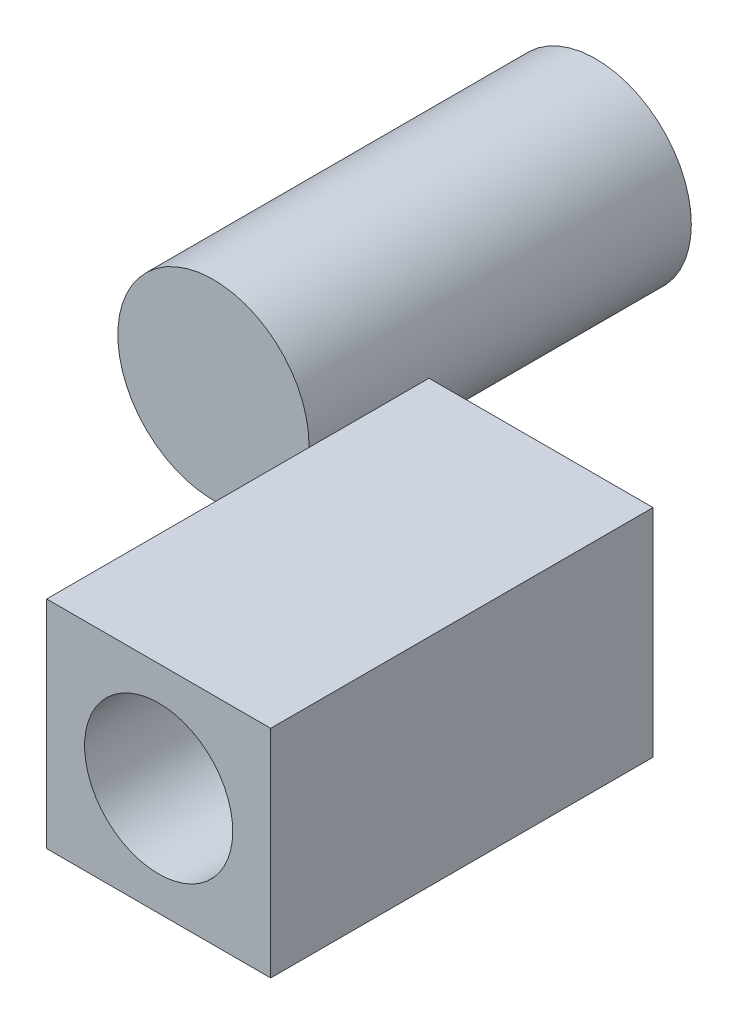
from build123d import *

# Parameters (mm, degrees)
ESQUISSE1_R        = 25
BOSS_EXTRU_1_DEPTH = 100
ESQUISSE2_W        = 58.591760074
ESQUISSE2_H        = 56.561352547
ESQUISSE2_R        = 19.375910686
BOSS_EXTRU_2_DEPTH = 100


with BuildPart() as part:
    # Esquisse1 → Boss.-Extru.1 (new body)
    with BuildSketch(Plane.XY):
        Circle(ESQUISSE1_R)
    extrude(amount=BOSS_EXTRU_1_DEPTH)


with BuildPart() as body_2:
    # Esquisse2 → Boss.-Extru.2 (new body)
    with BuildSketch(Plane.XY.offset(100)):
        with Locations((85.683024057, 2.560156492)):
            Rectangle(ESQUISSE2_W, ESQUISSE2_H)
        with Locations((85.683024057, 2.560156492)):
            Circle(ESQUISSE2_R, mode=Mode.SUBTRACT)
    extrude(amount=BOSS_EXTRU_2_DEPTH)


solid = Compound([part.part, body_2.part])
